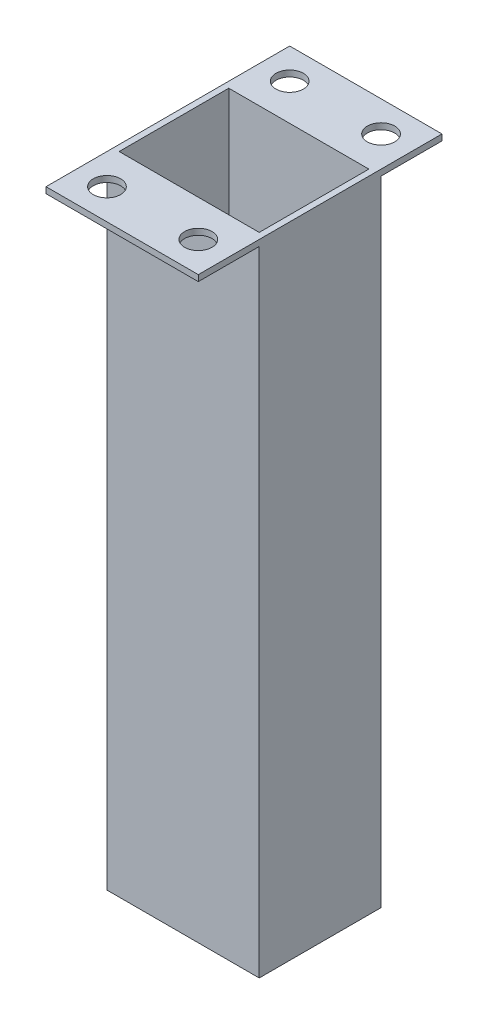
ISO-10303-21;
HEADER;
FILE_DESCRIPTION(('STEP AP214'),'2;1');
FILE_NAME('part.step','',(''),(''),'','','');
FILE_SCHEMA(('AUTOMOTIVE_DESIGN { 1 0 10303 214 1 1 1 1 }'));
ENDSEC;
DATA;
#1=APPLICATION_CONTEXT('core data for automotive mechanical design processes');
#2=APPLICATION_PROTOCOL_DEFINITION('international standard','automotive_design',2000,#1);
#3=PRODUCT_CONTEXT('',#1,'mechanical');
#4=PRODUCT('Part','Part','',(#3));
#5=PRODUCT_RELATED_PRODUCT_CATEGORY('part','',(#4));
#6=PRODUCT_DEFINITION_FORMATION('','',#4);
#7=PRODUCT_DEFINITION_CONTEXT('part definition',#1,'design');
#8=PRODUCT_DEFINITION('design','',#6,#7);
#9=PRODUCT_DEFINITION_SHAPE('','',#8);
#10=(LENGTH_UNIT() NAMED_UNIT(*) SI_UNIT(.MILLI.,.METRE.));
#11=(NAMED_UNIT(*) PLANE_ANGLE_UNIT() SI_UNIT($,.RADIAN.));
#12=(NAMED_UNIT(*) SI_UNIT($,.STERADIAN.) SOLID_ANGLE_UNIT());
#13=UNCERTAINTY_MEASURE_WITH_UNIT(LENGTH_MEASURE(1.E-05),#10,'distance_accuracy_value','');
#14=(GEOMETRIC_REPRESENTATION_CONTEXT(3) GLOBAL_UNCERTAINTY_ASSIGNED_CONTEXT((#13)) GLOBAL_UNIT_ASSIGNED_CONTEXT((#10,
#11,#12)) REPRESENTATION_CONTEXT('',''));
#15=CARTESIAN_POINT('',(0.,0.,0.));
#16=DIRECTION('',(0.,0.,1.));
#17=DIRECTION('',(1.,0.,0.));
#18=AXIS2_PLACEMENT_3D('',#15,#16,#17);
#19=CARTESIAN_POINT('',(0.,-2.27373675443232E-13,40.));
#20=DIRECTION('',(0.,1.,0.));
#21=DIRECTION('',(0.,0.,1.));
#22=AXIS2_PLACEMENT_3D('',#19,#20,#21);
#23=PLANE('',#22);
#24=DIRECTION('',(0.,0.,1.));
#25=VECTOR('',#24,1.);
#26=CARTESIAN_POINT('',(1.,-2.22044604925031E-13,29.));
#27=LINE('',#26,#25);
#28=CARTESIAN_POINT('',(1.,-2.22044604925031E-13,11.));
#29=VERTEX_POINT('',#28);
#30=CARTESIAN_POINT('',(1.,-2.22044604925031E-13,29.));
#31=VERTEX_POINT('',#30);
#32=EDGE_CURVE('E130',#29,#31,#27,.T.);
#33=ORIENTED_EDGE('',*,*,#32,.T.);
#34=DIRECTION('',(1.,0.,0.));
#35=VECTOR('',#34,1.);
#36=CARTESIAN_POINT('',(1.,-2.22044604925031E-13,29.));
#37=LINE('',#36,#35);
#38=CARTESIAN_POINT('',(24.,-2.22044604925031E-13,29.));
#39=VERTEX_POINT('',#38);
#40=EDGE_CURVE('E124',#31,#39,#37,.T.);
#41=ORIENTED_EDGE('',*,*,#40,.T.);
#42=DIRECTION('',(0.,0.,-1.));
#43=VECTOR('',#42,1.);
#44=CARTESIAN_POINT('',(24.,-2.22044604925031E-13,29.));
#45=LINE('',#44,#43);
#46=CARTESIAN_POINT('',(24.,-2.27373675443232E-13,11.));
#47=VERTEX_POINT('',#46);
#48=EDGE_CURVE('E133',#39,#47,#45,.T.);
#49=ORIENTED_EDGE('',*,*,#48,.T.);
#50=DIRECTION('',(-1.,0.,0.));
#51=VECTOR('',#50,1.);
#52=CARTESIAN_POINT('',(1.,-2.22044604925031E-13,11.));
#53=LINE('',#52,#51);
#54=EDGE_CURVE('E49',#47,#29,#53,.T.);
#55=ORIENTED_EDGE('',*,*,#54,.T.);
#56=EDGE_LOOP('',(#33,#41,#49,#55));
#57=FACE_BOUND('',#56,.T.);
#58=DIRECTION('',(1.,0.,0.));
#59=VECTOR('',#58,1.);
#60=CARTESIAN_POINT('',(-15.,0.,30.0000000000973));
#61=LINE('',#60,#59);
#62=CARTESIAN_POINT('',(0.,0.,30.0000000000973));
#63=VERTEX_POINT('',#62);
#64=CARTESIAN_POINT('',(25.,0.,30.0000000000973));
#65=VERTEX_POINT('',#64);
#66=EDGE_CURVE('E185',#63,#65,#61,.T.);
#67=ORIENTED_EDGE('',*,*,#66,.F.);
#68=DIRECTION('',(0.,0.,-1.));
#69=VECTOR('',#68,1.);
#70=CARTESIAN_POINT('',(0.,-2.27373675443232E-13,40.));
#71=LINE('',#70,#69);
#72=CARTESIAN_POINT('',(0.,0.,10.0000000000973));
#73=VERTEX_POINT('',#72);
#74=EDGE_CURVE('E206',#63,#73,#71,.T.);
#75=ORIENTED_EDGE('',*,*,#74,.T.);
#76=DIRECTION('',(1.,0.,0.));
#77=VECTOR('',#76,1.);
#78=CARTESIAN_POINT('',(-15.,0.,10.0000000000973));
#79=LINE('',#78,#77);
#80=CARTESIAN_POINT('',(25.,0.,10.0000000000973));
#81=VERTEX_POINT('',#80);
#82=EDGE_CURVE('E184',#73,#81,#79,.T.);
#83=ORIENTED_EDGE('',*,*,#82,.T.);
#84=DIRECTION('',(0.,0.,-1.));
#85=VECTOR('',#84,1.);
#86=CARTESIAN_POINT('',(25.,-2.27373675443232E-13,40.));
#87=LINE('',#86,#85);
#88=EDGE_CURVE('E220',#65,#81,#87,.T.);
#89=ORIENTED_EDGE('',*,*,#88,.F.);
#90=EDGE_LOOP('',(#67,#75,#83,#89));
#91=FACE_BOUND('',#90,.T.);
#92=ADVANCED_FACE('F33',(#57,#91),#23,.F.);
#93=CARTESIAN_POINT('',(25.,-2.27373675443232E-13,40.));
#94=DIRECTION('',(-1.,0.,0.));
#95=DIRECTION('',(0.,0.,1.));
#96=AXIS2_PLACEMENT_3D('',#93,#94,#95);
#97=PLANE('',#96);
#98=DIRECTION('',(0.,-1.,0.));
#99=VECTOR('',#98,1.);
#100=CARTESIAN_POINT('',(25.,0.,30.0000000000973));
#101=LINE('',#100,#99);
#102=CARTESIAN_POINT('',(25.,104.,30.0000000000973));
#103=VERTEX_POINT('',#102);
#104=EDGE_CURVE('E181',#103,#65,#101,.T.);
#105=ORIENTED_EDGE('',*,*,#104,.T.);
#106=ORIENTED_EDGE('',*,*,#88,.T.);
#107=DIRECTION('',(0.,1.,0.));
#108=VECTOR('',#107,1.);
#109=CARTESIAN_POINT('',(25.,0.,10.0000000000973));
#110=LINE('',#109,#108);
#111=CARTESIAN_POINT('',(25.,104.,10.0000000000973));
#112=VERTEX_POINT('',#111);
#113=EDGE_CURVE('E172',#81,#112,#110,.T.);
#114=ORIENTED_EDGE('',*,*,#113,.T.);
#115=DIRECTION('',(0.,0.,-1.));
#116=VECTOR('',#115,1.);
#117=CARTESIAN_POINT('',(25.,104.,10.0000000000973));
#118=LINE('',#117,#116);
#119=CARTESIAN_POINT('',(25.,104.,9.64064383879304E-11));
#120=VERTEX_POINT('',#119);
#121=EDGE_CURVE('E175',#112,#120,#118,.T.);
#122=ORIENTED_EDGE('',*,*,#121,.T.);
#123=DIRECTION('',(0.,1.,0.));
#124=VECTOR('',#123,1.);
#125=CARTESIAN_POINT('',(25.,-2.27373675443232E-13,0.));
#126=LINE('',#125,#124);
#127=CARTESIAN_POINT('',(25.,105.,0.));
#128=VERTEX_POINT('',#127);
#129=EDGE_CURVE('E197',#120,#128,#126,.T.);
#130=ORIENTED_EDGE('',*,*,#129,.T.);
#131=DIRECTION('',(0.,0.,-1.));
#132=VECTOR('',#131,1.);
#133=CARTESIAN_POINT('',(25.,105.,40.));
#134=LINE('',#133,#132);
#135=CARTESIAN_POINT('',(25.,105.,40.));
#136=VERTEX_POINT('',#135);
#137=EDGE_CURVE('E217',#136,#128,#134,.T.);
#138=ORIENTED_EDGE('',*,*,#137,.F.);
#139=DIRECTION('',(0.,1.,0.));
#140=VECTOR('',#139,1.);
#141=CARTESIAN_POINT('',(25.,-2.27373675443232E-13,40.));
#142=LINE('',#141,#140);
#143=CARTESIAN_POINT('',(25.,104.,40.));
#144=VERTEX_POINT('',#143);
#145=EDGE_CURVE('E198',#144,#136,#142,.T.);
#146=ORIENTED_EDGE('',*,*,#145,.F.);
#147=DIRECTION('',(0.,0.,-1.));
#148=VECTOR('',#147,1.);
#149=CARTESIAN_POINT('',(25.,104.,40.0000000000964));
#150=LINE('',#149,#148);
#151=EDGE_CURVE('E178',#144,#103,#150,.T.);
#152=ORIENTED_EDGE('',*,*,#151,.T.);
#153=EDGE_LOOP('',(#105,#106,#114,#122,#130,#138,#146,#152));
#154=FACE_BOUND('',#153,.T.);
#155=ADVANCED_FACE('F259',(#154),#97,.F.);
#156=CARTESIAN_POINT('',(0.,-2.27373675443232E-13,40.));
#157=DIRECTION('',(1.,0.,0.));
#158=DIRECTION('',(0.,0.,-1.));
#159=AXIS2_PLACEMENT_3D('',#156,#157,#158);
#160=PLANE('',#159);
#161=DIRECTION('',(0.,-1.,0.));
#162=VECTOR('',#161,1.);
#163=CARTESIAN_POINT('',(0.,-2.27373675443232E-13,30.0000000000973));
#164=LINE('',#163,#162);
#165=CARTESIAN_POINT('',(0.,104.,30.0000000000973));
#166=VERTEX_POINT('',#165);
#167=EDGE_CURVE('E12',#166,#63,#164,.T.);
#168=ORIENTED_EDGE('',*,*,#167,.F.);
#169=DIRECTION('',(0.,0.,-1.));
#170=VECTOR('',#169,1.);
#171=CARTESIAN_POINT('',(0.,104.,39.9999999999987));
#172=LINE('',#171,#170);
#173=CARTESIAN_POINT('',(0.,104.,40.0000000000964));
#174=VERTEX_POINT('',#173);
#175=EDGE_CURVE('E195',#174,#166,#172,.T.);
#176=ORIENTED_EDGE('',*,*,#175,.F.);
#177=DIRECTION('',(0.,-1.,0.));
#178=VECTOR('',#177,1.);
#179=CARTESIAN_POINT('',(0.,-2.27373675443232E-13,40.));
#180=LINE('',#179,#178);
#181=CARTESIAN_POINT('',(0.,105.,40.));
#182=VERTEX_POINT('',#181);
#183=EDGE_CURVE('E203',#182,#174,#180,.T.);
#184=ORIENTED_EDGE('',*,*,#183,.F.);
#185=DIRECTION('',(0.,0.,-1.));
#186=VECTOR('',#185,1.);
#187=CARTESIAN_POINT('',(0.,105.,40.));
#188=LINE('',#187,#186);
#189=CARTESIAN_POINT('',(0.,105.,0.));
#190=VERTEX_POINT('',#189);
#191=EDGE_CURVE('E214',#182,#190,#188,.T.);
#192=ORIENTED_EDGE('',*,*,#191,.T.);
#193=DIRECTION('',(0.,-1.,0.));
#194=VECTOR('',#193,1.);
#195=CARTESIAN_POINT('',(0.,-2.27373675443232E-13,0.));
#196=LINE('',#195,#194);
#197=CARTESIAN_POINT('',(0.,104.,0.));
#198=VERTEX_POINT('',#197);
#199=EDGE_CURVE('E201',#190,#198,#196,.T.);
#200=ORIENTED_EDGE('',*,*,#199,.T.);
#201=DIRECTION('',(0.,0.,-1.));
#202=VECTOR('',#201,1.);
#203=CARTESIAN_POINT('',(0.,104.,40.));
#204=LINE('',#203,#202);
#205=CARTESIAN_POINT('',(0.,104.,10.0000000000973));
#206=VERTEX_POINT('',#205);
#207=EDGE_CURVE('E187',#206,#198,#204,.T.);
#208=ORIENTED_EDGE('',*,*,#207,.F.);
#209=DIRECTION('',(0.,1.,0.));
#210=VECTOR('',#209,1.);
#211=CARTESIAN_POINT('',(0.,-2.27373675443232E-13,10.0000000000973));
#212=LINE('',#211,#210);
#213=EDGE_CURVE('E41',#73,#206,#212,.T.);
#214=ORIENTED_EDGE('',*,*,#213,.F.);
#215=ORIENTED_EDGE('',*,*,#74,.F.);
#216=EDGE_LOOP('',(#168,#176,#184,#192,#200,#208,#214,#215));
#217=FACE_BOUND('',#216,.T.);
#218=ADVANCED_FACE('F254',(#217),#160,.F.);
#219=CARTESIAN_POINT('',(25.,-2.27373675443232E-13,40.));
#220=DIRECTION('',(0.,0.,1.));
#221=DIRECTION('',(1.,0.,0.));
#222=AXIS2_PLACEMENT_3D('',#219,#220,#221);
#223=PLANE('',#222);
#224=ORIENTED_EDGE('',*,*,#183,.T.);
#225=DIRECTION('',(1.,0.,0.));
#226=VECTOR('',#225,1.);
#227=CARTESIAN_POINT('',(25.,104.,40.));
#228=LINE('',#227,#226);
#229=EDGE_CURVE('E225',#174,#144,#228,.T.);
#230=ORIENTED_EDGE('',*,*,#229,.T.);
#231=ORIENTED_EDGE('',*,*,#145,.T.);
#232=DIRECTION('',(-1.,0.,0.));
#233=VECTOR('',#232,1.);
#234=CARTESIAN_POINT('',(0.,105.,40.));
#235=LINE('',#234,#233);
#236=EDGE_CURVE('E200',#136,#182,#235,.T.);
#237=ORIENTED_EDGE('',*,*,#236,.T.);
#238=EDGE_LOOP('',(#224,#230,#231,#237));
#239=FACE_BOUND('',#238,.T.);
#240=ADVANCED_FACE('F263',(#239),#223,.T.);
#241=CARTESIAN_POINT('',(25.,-2.27373675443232E-13,0.));
#242=DIRECTION('',(0.,0.,1.));
#243=DIRECTION('',(1.,0.,0.));
#244=AXIS2_PLACEMENT_3D('',#241,#242,#243);
#245=PLANE('',#244);
#246=DIRECTION('',(1.,0.,0.));
#247=VECTOR('',#246,1.);
#248=CARTESIAN_POINT('',(25.,104.,0.));
#249=LINE('',#248,#247);
#250=EDGE_CURVE('E223',#198,#120,#249,.T.);
#251=ORIENTED_EDGE('',*,*,#250,.F.);
#252=ORIENTED_EDGE('',*,*,#199,.F.);
#253=DIRECTION('',(-1.,0.,0.));
#254=VECTOR('',#253,1.);
#255=CARTESIAN_POINT('',(0.,105.,0.));
#256=LINE('',#255,#254);
#257=EDGE_CURVE('E208',#128,#190,#256,.T.);
#258=ORIENTED_EDGE('',*,*,#257,.F.);
#259=ORIENTED_EDGE('',*,*,#129,.F.);
#260=EDGE_LOOP('',(#251,#252,#258,#259));
#261=FACE_BOUND('',#260,.T.);
#262=ADVANCED_FACE('F271',(#261),#245,.F.);
#263=CARTESIAN_POINT('',(0.,105.,40.));
#264=DIRECTION('',(0.,-1.,0.));
#265=DIRECTION('',(0.,0.,-1.));
#266=AXIS2_PLACEMENT_3D('',#263,#264,#265);
#267=PLANE('',#266);
#268=DIRECTION('',(0.,0.,-1.));
#269=VECTOR('',#268,1.);
#270=CARTESIAN_POINT('',(24.,105.,29.));
#271=LINE('',#270,#269);
#272=CARTESIAN_POINT('',(24.,105.,29.));
#273=VERTEX_POINT('',#272);
#274=CARTESIAN_POINT('',(24.,105.,11.));
#275=VERTEX_POINT('',#274);
#276=EDGE_CURVE('E148',#273,#275,#271,.T.);
#277=ORIENTED_EDGE('',*,*,#276,.F.);
#278=DIRECTION('',(1.,0.,0.));
#279=VECTOR('',#278,1.);
#280=CARTESIAN_POINT('',(1.,105.,29.));
#281=LINE('',#280,#279);
#282=CARTESIAN_POINT('',(1.,105.,29.));
#283=VERTEX_POINT('',#282);
#284=EDGE_CURVE('E57',#283,#273,#281,.T.);
#285=ORIENTED_EDGE('',*,*,#284,.F.);
#286=DIRECTION('',(0.,0.,1.));
#287=VECTOR('',#286,1.);
#288=CARTESIAN_POINT('',(1.,105.,29.));
#289=LINE('',#288,#287);
#290=CARTESIAN_POINT('',(1.,105.,11.));
#291=VERTEX_POINT('',#290);
#292=EDGE_CURVE('E139',#291,#283,#289,.T.);
#293=ORIENTED_EDGE('',*,*,#292,.F.);
#294=DIRECTION('',(-1.,0.,0.));
#295=VECTOR('',#294,1.);
#296=CARTESIAN_POINT('',(1.,105.,11.));
#297=LINE('',#296,#295);
#298=EDGE_CURVE('E142',#275,#291,#297,.T.);
#299=ORIENTED_EDGE('',*,*,#298,.F.);
#300=EDGE_LOOP('',(#277,#285,#293,#299));
#301=FACE_BOUND('',#300,.T.);
#302=CARTESIAN_POINT('',(19.9999999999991,105.,35.));
#303=DIRECTION('',(0.,1.,0.));
#304=DIRECTION('',(0.,0.,1.));
#305=AXIS2_PLACEMENT_3D('',#302,#303,#304);
#306=CIRCLE('',#305,2.25);
#307=CARTESIAN_POINT('',(19.9999999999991,105.,37.25));
#308=VERTEX_POINT('',#307);
#309=EDGE_CURVE('E154',#308,#308,#306,.T.);
#310=ORIENTED_EDGE('',*,*,#309,.F.);
#311=EDGE_LOOP('',(#310));
#312=FACE_BOUND('',#311,.T.);
#313=CARTESIAN_POINT('',(5.,105.,35.));
#314=DIRECTION('',(0.,1.,0.));
#315=DIRECTION('',(0.,0.,1.));
#316=AXIS2_PLACEMENT_3D('',#313,#314,#315);
#317=CIRCLE('',#316,2.25);
#318=CARTESIAN_POINT('',(5.,105.,37.25));
#319=VERTEX_POINT('',#318);
#320=EDGE_CURVE('E160',#319,#319,#317,.T.);
#321=ORIENTED_EDGE('',*,*,#320,.F.);
#322=EDGE_LOOP('',(#321));
#323=FACE_BOUND('',#322,.T.);
#324=CARTESIAN_POINT('',(20.,105.,5.));
#325=DIRECTION('',(0.,1.,0.));
#326=DIRECTION('',(0.,0.,1.));
#327=AXIS2_PLACEMENT_3D('',#324,#325,#326);
#328=CIRCLE('',#327,2.25);
#329=CARTESIAN_POINT('',(20.,105.,7.25));
#330=VERTEX_POINT('',#329);
#331=EDGE_CURVE('E164',#330,#330,#328,.T.);
#332=ORIENTED_EDGE('',*,*,#331,.F.);
#333=EDGE_LOOP('',(#332));
#334=FACE_BOUND('',#333,.T.);
#335=CARTESIAN_POINT('',(5.,105.,5.));
#336=DIRECTION('',(0.,1.,0.));
#337=DIRECTION('',(0.,0.,1.));
#338=AXIS2_PLACEMENT_3D('',#335,#336,#337);
#339=CIRCLE('',#338,2.25);
#340=CARTESIAN_POINT('',(5.,105.,7.25));
#341=VERTEX_POINT('',#340);
#342=EDGE_CURVE('E168',#341,#341,#339,.T.);
#343=ORIENTED_EDGE('',*,*,#342,.F.);
#344=EDGE_LOOP('',(#343));
#345=FACE_BOUND('',#344,.T.);
#346=ORIENTED_EDGE('',*,*,#257,.T.);
#347=ORIENTED_EDGE('',*,*,#191,.F.);
#348=ORIENTED_EDGE('',*,*,#236,.F.);
#349=ORIENTED_EDGE('',*,*,#137,.T.);
#350=EDGE_LOOP('',(#346,#347,#348,#349));
#351=FACE_BOUND('',#350,.T.);
#352=ADVANCED_FACE('F286',(#301,#312,#323,#334,#345,#351),#267,.F.);
#353=CARTESIAN_POINT('',(-15.,104.,10.0000000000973));
#354=DIRECTION('',(0.,-1.,0.));
#355=DIRECTION('',(0.,0.,-1.));
#356=AXIS2_PLACEMENT_3D('',#353,#354,#355);
#357=PLANE('',#356);
#358=CARTESIAN_POINT('',(20.,104.,5.));
#359=DIRECTION('',(0.,-1.,0.));
#360=DIRECTION('',(0.,0.,-1.));
#361=AXIS2_PLACEMENT_3D('',#358,#359,#360);
#362=CIRCLE('',#361,2.25);
#363=CARTESIAN_POINT('',(20.,104.,2.75));
#364=VERTEX_POINT('',#363);
#365=EDGE_CURVE('E167',#364,#364,#362,.T.);
#366=ORIENTED_EDGE('',*,*,#365,.F.);
#367=EDGE_LOOP('',(#366));
#368=FACE_BOUND('',#367,.T.);
#369=CARTESIAN_POINT('',(5.,104.,5.));
#370=DIRECTION('',(0.,-1.,0.));
#371=DIRECTION('',(0.,0.,-1.));
#372=AXIS2_PLACEMENT_3D('',#369,#370,#371);
#373=CIRCLE('',#372,2.25);
#374=CARTESIAN_POINT('',(5.,104.,2.75));
#375=VERTEX_POINT('',#374);
#376=EDGE_CURVE('E171',#375,#375,#373,.T.);
#377=ORIENTED_EDGE('',*,*,#376,.F.);
#378=EDGE_LOOP('',(#377));
#379=FACE_BOUND('',#378,.T.);
#380=ORIENTED_EDGE('',*,*,#207,.T.);
#381=ORIENTED_EDGE('',*,*,#250,.T.);
#382=ORIENTED_EDGE('',*,*,#121,.F.);
#383=DIRECTION('',(1.,0.,0.));
#384=VECTOR('',#383,1.);
#385=CARTESIAN_POINT('',(-15.,104.,10.0000000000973));
#386=LINE('',#385,#384);
#387=EDGE_CURVE('E190',#206,#112,#386,.T.);
#388=ORIENTED_EDGE('',*,*,#387,.F.);
#389=EDGE_LOOP('',(#380,#381,#382,#388));
#390=FACE_BOUND('',#389,.T.);
#391=ADVANCED_FACE('F275',(#368,#379,#390),#357,.T.);
#392=CARTESIAN_POINT('',(-15.,0.,10.0000000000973));
#393=DIRECTION('',(0.,0.,-1.));
#394=DIRECTION('',(-1.,0.,0.));
#395=AXIS2_PLACEMENT_3D('',#392,#393,#394);
#396=PLANE('',#395);
#397=ORIENTED_EDGE('',*,*,#213,.T.);
#398=ORIENTED_EDGE('',*,*,#387,.T.);
#399=ORIENTED_EDGE('',*,*,#113,.F.);
#400=ORIENTED_EDGE('',*,*,#82,.F.);
#401=EDGE_LOOP('',(#397,#398,#399,#400));
#402=FACE_BOUND('',#401,.T.);
#403=ADVANCED_FACE('F278',(#402),#396,.T.);
#404=CARTESIAN_POINT('',(-15.,0.,30.0000000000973));
#405=DIRECTION('',(0.,0.,1.));
#406=DIRECTION('',(1.,0.,0.));
#407=AXIS2_PLACEMENT_3D('',#404,#405,#406);
#408=PLANE('',#407);
#409=ORIENTED_EDGE('',*,*,#167,.T.);
#410=ORIENTED_EDGE('',*,*,#66,.T.);
#411=ORIENTED_EDGE('',*,*,#104,.F.);
#412=DIRECTION('',(1.,0.,0.));
#413=VECTOR('',#412,1.);
#414=CARTESIAN_POINT('',(-15.,104.,30.0000000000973));
#415=LINE('',#414,#413);
#416=EDGE_CURVE('E188',#166,#103,#415,.T.);
#417=ORIENTED_EDGE('',*,*,#416,.F.);
#418=EDGE_LOOP('',(#409,#410,#411,#417));
#419=FACE_BOUND('',#418,.T.);
#420=ADVANCED_FACE('F242',(#419),#408,.T.);
#421=CARTESIAN_POINT('',(-15.,104.,40.0000000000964));
#422=DIRECTION('',(0.,-1.,0.));
#423=DIRECTION('',(0.,0.,-1.));
#424=AXIS2_PLACEMENT_3D('',#421,#422,#423);
#425=PLANE('',#424);
#426=CARTESIAN_POINT('',(19.9999999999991,104.,35.));
#427=DIRECTION('',(0.,-1.,0.));
#428=DIRECTION('',(0.,0.,-1.));
#429=AXIS2_PLACEMENT_3D('',#426,#427,#428);
#430=CIRCLE('',#429,2.25);
#431=CARTESIAN_POINT('',(19.9999999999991,104.,32.75));
#432=VERTEX_POINT('',#431);
#433=EDGE_CURVE('E36',#432,#432,#430,.T.);
#434=ORIENTED_EDGE('',*,*,#433,.F.);
#435=EDGE_LOOP('',(#434));
#436=FACE_BOUND('',#435,.T.);
#437=CARTESIAN_POINT('',(5.,104.,35.));
#438=DIRECTION('',(0.,-1.,0.));
#439=DIRECTION('',(0.,0.,-1.));
#440=AXIS2_PLACEMENT_3D('',#437,#438,#439);
#441=CIRCLE('',#440,2.25);
#442=CARTESIAN_POINT('',(5.,104.,32.75));
#443=VERTEX_POINT('',#442);
#444=EDGE_CURVE('E163',#443,#443,#441,.T.);
#445=ORIENTED_EDGE('',*,*,#444,.F.);
#446=EDGE_LOOP('',(#445));
#447=FACE_BOUND('',#446,.T.);
#448=ORIENTED_EDGE('',*,*,#175,.T.);
#449=ORIENTED_EDGE('',*,*,#416,.T.);
#450=ORIENTED_EDGE('',*,*,#151,.F.);
#451=ORIENTED_EDGE('',*,*,#229,.F.);
#452=EDGE_LOOP('',(#448,#449,#450,#451));
#453=FACE_BOUND('',#452,.T.);
#454=ADVANCED_FACE('F238',(#436,#447,#453),#425,.T.);
#455=CARTESIAN_POINT('',(5.,64.9999999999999,5.));
#456=DIRECTION('',(0.,1.,0.));
#457=DIRECTION('',(0.,0.,1.));
#458=AXIS2_PLACEMENT_3D('',#455,#456,#457);
#459=CYLINDRICAL_SURFACE('',#458,2.25);
#460=ORIENTED_EDGE('',*,*,#376,.T.);
#461=EDGE_LOOP('',(#460));
#462=FACE_BOUND('',#461,.T.);
#463=ORIENTED_EDGE('',*,*,#342,.T.);
#464=EDGE_LOOP('',(#463));
#465=FACE_BOUND('',#464,.T.);
#466=ADVANCED_FACE('F241',(#462,#465),#459,.F.);
#467=CARTESIAN_POINT('',(20.,64.9999999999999,5.));
#468=DIRECTION('',(0.,1.,0.));
#469=DIRECTION('',(0.,0.,1.));
#470=AXIS2_PLACEMENT_3D('',#467,#468,#469);
#471=CYLINDRICAL_SURFACE('',#470,2.25);
#472=ORIENTED_EDGE('',*,*,#365,.T.);
#473=EDGE_LOOP('',(#472));
#474=FACE_BOUND('',#473,.T.);
#475=ORIENTED_EDGE('',*,*,#331,.T.);
#476=EDGE_LOOP('',(#475));
#477=FACE_BOUND('',#476,.T.);
#478=ADVANCED_FACE('F341',(#474,#477),#471,.F.);
#479=CARTESIAN_POINT('',(5.,64.9999999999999,35.));
#480=DIRECTION('',(0.,1.,0.));
#481=DIRECTION('',(0.,0.,1.));
#482=AXIS2_PLACEMENT_3D('',#479,#480,#481);
#483=CYLINDRICAL_SURFACE('',#482,2.25);
#484=ORIENTED_EDGE('',*,*,#444,.T.);
#485=EDGE_LOOP('',(#484));
#486=FACE_BOUND('',#485,.T.);
#487=ORIENTED_EDGE('',*,*,#320,.T.);
#488=EDGE_LOOP('',(#487));
#489=FACE_BOUND('',#488,.T.);
#490=ADVANCED_FACE('F235',(#486,#489),#483,.F.);
#491=CARTESIAN_POINT('',(19.9999999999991,64.9999999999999,35.));
#492=DIRECTION('',(0.,1.,0.));
#493=DIRECTION('',(0.,0.,1.));
#494=AXIS2_PLACEMENT_3D('',#491,#492,#493);
#495=CYLINDRICAL_SURFACE('',#494,2.25);
#496=ORIENTED_EDGE('',*,*,#433,.T.);
#497=EDGE_LOOP('',(#496));
#498=FACE_BOUND('',#497,.T.);
#499=ORIENTED_EDGE('',*,*,#309,.T.);
#500=EDGE_LOOP('',(#499));
#501=FACE_BOUND('',#500,.T.);
#502=ADVANCED_FACE('F360',(#498,#501),#495,.F.);
#503=CARTESIAN_POINT('',(1.,-2.22044604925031E-13,29.));
#504=DIRECTION('',(0.,0.,1.));
#505=DIRECTION('',(1.,0.,0.));
#506=AXIS2_PLACEMENT_3D('',#503,#504,#505);
#507=PLANE('',#506);
#508=ORIENTED_EDGE('',*,*,#284,.T.);
#509=DIRECTION('',(0.,1.,0.));
#510=VECTOR('',#509,1.);
#511=CARTESIAN_POINT('',(24.,-2.22044604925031E-13,29.));
#512=LINE('',#511,#510);
#513=EDGE_CURVE('E120',#39,#273,#512,.T.);
#514=ORIENTED_EDGE('',*,*,#513,.F.);
#515=ORIENTED_EDGE('',*,*,#40,.F.);
#516=DIRECTION('',(0.,1.,0.));
#517=VECTOR('',#516,1.);
#518=CARTESIAN_POINT('',(1.,-2.22044604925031E-13,29.));
#519=LINE('',#518,#517);
#520=EDGE_CURVE('E152',#31,#283,#519,.T.);
#521=ORIENTED_EDGE('',*,*,#520,.T.);
#522=EDGE_LOOP('',(#508,#514,#515,#521));
#523=FACE_BOUND('',#522,.T.);
#524=ADVANCED_FACE('F122',(#523),#507,.F.);
#525=CARTESIAN_POINT('',(1.,-2.22044604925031E-13,29.));
#526=DIRECTION('',(-1.,0.,0.));
#527=DIRECTION('',(0.,0.,1.));
#528=AXIS2_PLACEMENT_3D('',#525,#526,#527);
#529=PLANE('',#528);
#530=ORIENTED_EDGE('',*,*,#292,.T.);
#531=ORIENTED_EDGE('',*,*,#520,.F.);
#532=ORIENTED_EDGE('',*,*,#32,.F.);
#533=DIRECTION('',(0.,1.,0.));
#534=VECTOR('',#533,1.);
#535=CARTESIAN_POINT('',(1.,-2.22044604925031E-13,11.));
#536=LINE('',#535,#534);
#537=EDGE_CURVE('E155',#29,#291,#536,.T.);
#538=ORIENTED_EDGE('',*,*,#537,.T.);
#539=EDGE_LOOP('',(#530,#531,#532,#538));
#540=FACE_BOUND('',#539,.T.);
#541=ADVANCED_FACE('F394',(#540),#529,.F.);
#542=CARTESIAN_POINT('',(1.,-2.22044604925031E-13,11.));
#543=DIRECTION('',(0.,0.,-1.));
#544=DIRECTION('',(-1.,0.,0.));
#545=AXIS2_PLACEMENT_3D('',#542,#543,#544);
#546=PLANE('',#545);
#547=ORIENTED_EDGE('',*,*,#298,.T.);
#548=ORIENTED_EDGE('',*,*,#537,.F.);
#549=ORIENTED_EDGE('',*,*,#54,.F.);
#550=DIRECTION('',(0.,1.,0.));
#551=VECTOR('',#550,1.);
#552=CARTESIAN_POINT('',(24.,-2.22044604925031E-13,11.));
#553=LINE('',#552,#551);
#554=EDGE_CURVE('E129',#47,#275,#553,.T.);
#555=ORIENTED_EDGE('',*,*,#554,.T.);
#556=EDGE_LOOP('',(#547,#548,#549,#555));
#557=FACE_BOUND('',#556,.T.);
#558=ADVANCED_FACE('F400',(#557),#546,.F.);
#559=CARTESIAN_POINT('',(24.,-2.22044604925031E-13,29.));
#560=DIRECTION('',(1.,0.,0.));
#561=DIRECTION('',(0.,0.,-1.));
#562=AXIS2_PLACEMENT_3D('',#559,#560,#561);
#563=PLANE('',#562);
#564=ORIENTED_EDGE('',*,*,#276,.T.);
#565=ORIENTED_EDGE('',*,*,#554,.F.);
#566=ORIENTED_EDGE('',*,*,#48,.F.);
#567=ORIENTED_EDGE('',*,*,#513,.T.);
#568=EDGE_LOOP('',(#564,#565,#566,#567));
#569=FACE_BOUND('',#568,.T.);
#570=ADVANCED_FACE('F134',(#569),#563,.F.);
#571=CLOSED_SHELL('',(#92,#155,#218,#240,#262,#352,#391,#403,#420,#454,#466,#478,#490,#502,#524,
#541,#558,#570));
#572=MANIFOLD_SOLID_BREP('B2',#571);
#573=ADVANCED_BREP_SHAPE_REPRESENTATION('',(#18,#572),#14);
#574=SHAPE_DEFINITION_REPRESENTATION(#9,#573);
ENDSEC;
END-ISO-10303-21;
